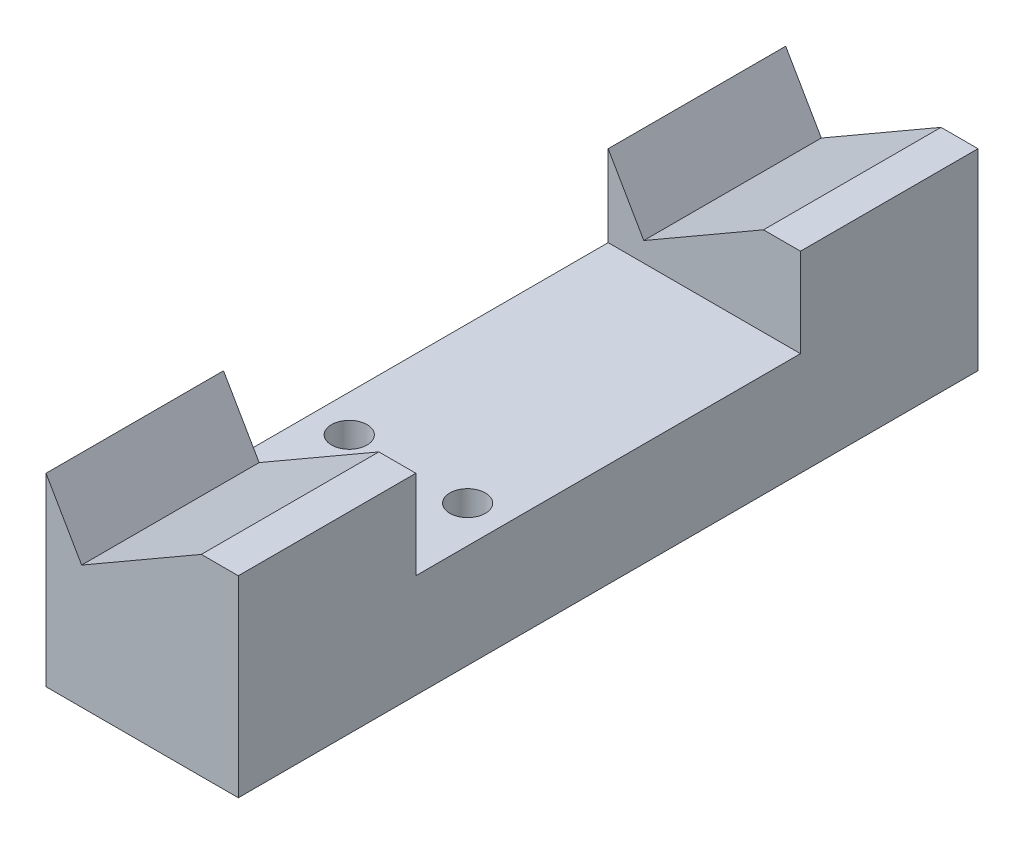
from build123d import *

# Parameters (mm, degrees)
EXTRUSION1_DEPTH        = 50
ESQUISSE2_W             = 26
ESQUISSE2_H             = 13.551704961
ENL_V_MAT_EXTRU_1_DEPTH = 54.272882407
TROU_TARAUD_M3X0_51_D   = 2.4


with BuildPart() as part:
    # Esquisse1 → Extrusion1 (new body)
    with BuildSketch(Plane.XY):
        Polygon((6.5, 13), (4, 13), (-4.091506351, 8.32836663), (-6.5, 12.5), (-6.5, 0), (6.5, 0), align=None)
    extrude(amount=EXTRUSION1_DEPTH)

    # Esquisse2 → Enl_v. mat.-Extru.1 (cut, through all)
    with BuildSketch(Plane(origin=(6.5, 0, 0), x_dir=(0, 0, -1), z_dir=(1, 0, 0))):
        with Locations((-25, 13.775852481)):
            Rectangle(ESQUISSE2_W, ESQUISSE2_H)
    extrude(amount=-ENL_V_MAT_EXTRU_1_DEPTH, mode=Mode.SUBTRACT)

    # Trou taraud_ M3x0.51 (through all)
    with Locations(Plane(origin=(0, 7, 0), x_dir=(-1, 0, 0), z_dir=(0, 1, 0))):
        with Locations((4, 32), (-4, 32)):
            Hole(TROU_TARAUD_M3X0_51_D / 2)


solid = part.part
